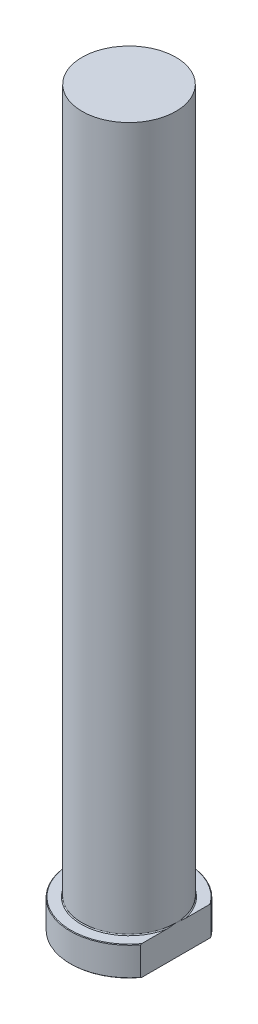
from build123d import *
from build123d.topology import SkipClean

# Parameters (mm, degrees)
CHAMFER1_SIZE = 0.2
FILLET1_R     = 0.3
KEY_DEPTH     = 252.594912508


with BuildPart() as part:
    # Sketch1 → Revolve1 (revolve)
    with BuildSketch(Plane.XY, mode=Mode.PRIVATE) as revolve1_sk:
        Polygon((0, 0), (-20, 0), (-20, 10), (-16, 10), (-16, 250), (0, 250), align=None)
    revolve(revolve1_sk.sketch.rotate(Axis((0, 259.958771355, 0), (0, -1, 0)), 270), axis=Axis((0, 259.958771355, 0), (0, -1, 0)))

    # Chamfer1
    chamfer1_edges = [part.edges().sort_by_distance(p)[0] for p in [
        (0, 10, -20),
        (0, 0, -20),
    ]]
    chamfer(chamfer1_edges, length=CHAMFER1_SIZE)

    # Fillet1
    fillet1_edges = [part.edges().sort_by_distance(p)[0] for p in [
        (0, 10, -16),
    ]]
    fillet(fillet1_edges, radius=FILLET1_R)

    # Sketch2 → KEY (cut, through all)
    with SkipClean():  # the faces are left unmerged after this step: merging them gives an invalid solid
        with BuildSketch(Plane(origin=(0, 0, 0), x_dir=(1, 0, 0), z_dir=(0, 1, 0))):
            with BuildLine():
                Line((16, 12), (16, -12))
                ThreePointArc((16, -12), (20, 0), (16, 12))
            make_face()
        extrude(amount=KEY_DEPTH, mode=Mode.SUBTRACT)


solid = part.part
